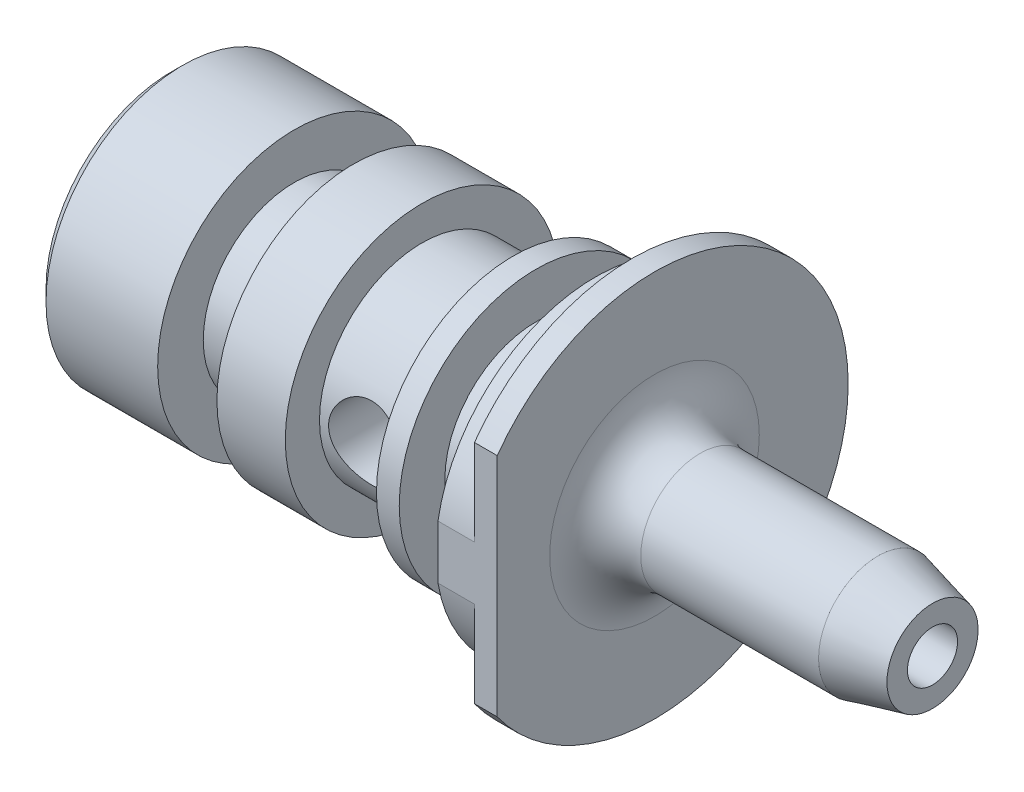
ISO-10303-21;
HEADER;
FILE_DESCRIPTION(('STEP AP214'),'2;1');
FILE_NAME('part.step','',(''),(''),'','','');
FILE_SCHEMA(('AUTOMOTIVE_DESIGN { 1 0 10303 214 1 1 1 1 }'));
ENDSEC;
DATA;
#1=APPLICATION_CONTEXT('core data for automotive mechanical design processes');
#2=APPLICATION_PROTOCOL_DEFINITION('international standard','automotive_design',2000,#1);
#3=PRODUCT_CONTEXT('',#1,'mechanical');
#4=PRODUCT('Part','Part','',(#3));
#5=PRODUCT_RELATED_PRODUCT_CATEGORY('part','',(#4));
#6=PRODUCT_DEFINITION_FORMATION('','',#4);
#7=PRODUCT_DEFINITION_CONTEXT('part definition',#1,'design');
#8=PRODUCT_DEFINITION('design','',#6,#7);
#9=PRODUCT_DEFINITION_SHAPE('','',#8);
#10=(LENGTH_UNIT() NAMED_UNIT(*) SI_UNIT(.MILLI.,.METRE.));
#11=(NAMED_UNIT(*) PLANE_ANGLE_UNIT() SI_UNIT($,.RADIAN.));
#12=(NAMED_UNIT(*) SI_UNIT($,.STERADIAN.) SOLID_ANGLE_UNIT());
#13=UNCERTAINTY_MEASURE_WITH_UNIT(LENGTH_MEASURE(1.E-05),#10,'distance_accuracy_value','');
#14=(GEOMETRIC_REPRESENTATION_CONTEXT(3) GLOBAL_UNCERTAINTY_ASSIGNED_CONTEXT((#13)) GLOBAL_UNIT_ASSIGNED_CONTEXT((#10,
#11,#12)) REPRESENTATION_CONTEXT('',''));
#15=CARTESIAN_POINT('',(0.,0.,0.));
#16=DIRECTION('',(0.,0.,1.));
#17=DIRECTION('',(1.,0.,0.));
#18=AXIS2_PLACEMENT_3D('',#15,#16,#17);
#19=CARTESIAN_POINT('',(0.00125000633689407,0.,0.));
#20=DIRECTION('',(-1.,0.,0.));
#21=DIRECTION('',(0.,0.,1.));
#22=AXIS2_PLACEMENT_3D('',#19,#20,#21);
#23=CYLINDRICAL_SURFACE('',#22,0.550000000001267);
#24=CARTESIAN_POINT('',(-9.4,0.,0.550000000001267));
#25=CARTESIAN_POINT('',(-9.39999999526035,-0.0274525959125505,0.55000003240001));
#26=CARTESIAN_POINT('',(-9.40142523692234,-0.054905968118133,0.547933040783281));
#27=CARTESIAN_POINT('',(-9.40698534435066,-0.108932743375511,0.539797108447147));
#28=CARTESIAN_POINT('',(-9.41112162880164,-0.135505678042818,0.533726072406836));
#29=CARTESIAN_POINT('',(-9.42169903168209,-0.186905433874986,0.517963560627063));
#30=CARTESIAN_POINT('',(-9.42812895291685,-0.211740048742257,0.508289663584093));
#31=CARTESIAN_POINT('',(-9.44278574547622,-0.259320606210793,0.485743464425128));
#32=CARTESIAN_POINT('',(-9.45101285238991,-0.282066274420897,0.472870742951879));
#33=CARTESIAN_POINT('',(-9.46947191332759,-0.32706324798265,0.443080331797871));
#34=CARTESIAN_POINT('',(-9.47981607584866,-0.349098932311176,0.425907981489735));
#35=CARTESIAN_POINT('',(-9.50121567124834,-0.390177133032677,0.38862925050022));
#36=CARTESIAN_POINT('',(-9.51227213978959,-0.409215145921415,0.36851854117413));
#37=CARTESIAN_POINT('',(-9.53613320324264,-0.447057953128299,0.322002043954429));
#38=CARTESIAN_POINT('',(-9.54891709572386,-0.465278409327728,0.295106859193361));
#39=CARTESIAN_POINT('',(-9.5727485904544,-0.496938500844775,0.237939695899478));
#40=CARTESIAN_POINT('',(-9.58379913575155,-0.510386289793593,0.207673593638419));
#41=CARTESIAN_POINT('',(-9.5994031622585,-0.528565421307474,0.153827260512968));
#42=CARTESIAN_POINT('',(-9.60491068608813,-0.534703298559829,0.131001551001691));
#43=CARTESIAN_POINT('',(-9.61341190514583,-0.544017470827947,0.0843156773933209));
#44=CARTESIAN_POINT('',(-9.61641027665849,-0.547199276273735,0.0604575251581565));
#45=CARTESIAN_POINT('',(-9.61942451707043,-0.550397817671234,0.012210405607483));
#46=CARTESIAN_POINT('',(-9.61942522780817,-0.550398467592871,-0.0121806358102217));
#47=CARTESIAN_POINT('',(-9.61640459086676,-0.547193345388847,-0.0605669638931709));
#48=CARTESIAN_POINT('',(-9.61338108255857,-0.543985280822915,-0.0845619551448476));
#49=CARTESIAN_POINT('',(-9.60505782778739,-0.534863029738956,-0.13011933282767));
#50=CARTESIAN_POINT('',(-9.59989856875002,-0.529114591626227,-0.151742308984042));
#51=CARTESIAN_POINT('',(-9.58793508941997,-0.515228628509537,-0.193724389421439));
#52=CARTESIAN_POINT('',(-9.5811295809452,-0.50708923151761,-0.214082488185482));
#53=CARTESIAN_POINT('',(-9.56276180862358,-0.483983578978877,-0.26330117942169));
#54=CARTESIAN_POINT('',(-9.55053156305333,-0.467644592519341,-0.291271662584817));
#55=CARTESIAN_POINT('',(-9.52535307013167,-0.430530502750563,-0.343772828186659));
#56=CARTESIAN_POINT('',(-9.51240347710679,-0.409746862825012,-0.368296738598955));
#57=CARTESIAN_POINT('',(-9.48702112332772,-0.363808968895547,-0.413759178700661));
#58=CARTESIAN_POINT('',(-9.47459464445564,-0.338614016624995,-0.434660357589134));
#59=CARTESIAN_POINT('',(-9.45165852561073,-0.284338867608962,-0.471943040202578));
#60=CARTESIAN_POINT('',(-9.4411449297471,-0.255266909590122,-0.488333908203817));
#61=CARTESIAN_POINT('',(-9.42517375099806,-0.200662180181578,-0.512757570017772));
#62=CARTESIAN_POINT('',(-9.41911197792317,-0.175774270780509,-0.521837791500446));
#63=CARTESIAN_POINT('',(-9.40932111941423,-0.124521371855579,-0.536378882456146));
#64=CARTESIAN_POINT('',(-9.40559045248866,-0.0981573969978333,-0.54184220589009));
#65=CARTESIAN_POINT('',(-9.4007883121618,-0.0445708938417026,-0.548858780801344));
#66=CARTESIAN_POINT('',(-9.39972646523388,-0.017345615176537,-0.550397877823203));
#67=CARTESIAN_POINT('',(-9.40039424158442,0.0369987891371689,-0.54942654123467));
#68=CARTESIAN_POINT('',(-9.40212391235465,0.0641179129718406,-0.546916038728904));
#69=CARTESIAN_POINT('',(-9.40802948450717,0.115854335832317,-0.538262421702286));
#70=CARTESIAN_POINT('',(-9.41205885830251,0.140525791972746,-0.532336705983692));
#71=CARTESIAN_POINT('',(-9.42212553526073,0.188444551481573,-0.51731967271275));
#72=CARTESIAN_POINT('',(-9.4281632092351,0.21169159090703,-0.508227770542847));
#73=CARTESIAN_POINT('',(-9.44235566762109,0.258085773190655,-0.486414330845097));
#74=CARTESIAN_POINT('',(-9.4506378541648,0.281086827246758,-0.473466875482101));
#75=CARTESIAN_POINT('',(-9.46846875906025,0.324681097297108,-0.444708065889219));
#76=CARTESIAN_POINT('',(-9.47801837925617,0.34527257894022,-0.42889466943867));
#77=CARTESIAN_POINT('',(-9.49944994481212,0.387132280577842,-0.391838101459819));
#78=CARTESIAN_POINT('',(-9.51145322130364,0.407926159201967,-0.370128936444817));
#79=CARTESIAN_POINT('',(-9.53532435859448,0.445765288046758,-0.323564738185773));
#80=CARTESIAN_POINT('',(-9.54719213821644,0.462808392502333,-0.298707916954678));
#81=CARTESIAN_POINT('',(-9.56814593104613,0.490946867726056,-0.249347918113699));
#82=CARTESIAN_POINT('',(-9.57739429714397,0.502518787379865,-0.225186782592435));
#83=CARTESIAN_POINT('',(-9.59378173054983,0.522172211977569,-0.174823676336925));
#84=CARTESIAN_POINT('',(-9.60092493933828,0.530260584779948,-0.148625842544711));
#85=CARTESIAN_POINT('',(-9.61099815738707,0.541408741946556,-0.0994654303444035));
#86=CARTESIAN_POINT('',(-9.61445206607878,0.545107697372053,-0.076758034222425));
#87=CARTESIAN_POINT('',(-9.61868335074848,0.549619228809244,-0.0308196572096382));
#88=CARTESIAN_POINT('',(-9.61946350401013,0.55043479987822,-0.00758924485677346));
#89=CARTESIAN_POINT('',(-9.61822478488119,0.549124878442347,0.0387101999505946));
#90=CARTESIAN_POINT('',(-9.61620575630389,0.546999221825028,0.0617792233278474));
#91=CARTESIAN_POINT('',(-9.60968507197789,0.539954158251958,0.107136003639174));
#92=CARTESIAN_POINT('',(-9.60517986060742,0.535030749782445,0.129422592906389));
#93=CARTESIAN_POINT('',(-9.59258975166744,0.520738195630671,0.179446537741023));
#94=CARTESIAN_POINT('',(-9.58383016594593,0.510467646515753,0.206753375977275));
#95=CARTESIAN_POINT('',(-9.56444321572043,0.486116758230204,0.258885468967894));
#96=CARTESIAN_POINT('',(-9.55381301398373,0.47203061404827,0.283706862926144));
#97=CARTESIAN_POINT('',(-9.53161493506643,0.440055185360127,0.331191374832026));
#98=CARTESIAN_POINT('',(-9.52003174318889,0.422090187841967,0.353796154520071));
#99=CARTESIAN_POINT('',(-9.49714288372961,0.382766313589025,0.396007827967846));
#100=CARTESIAN_POINT('',(-9.48583730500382,0.361406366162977,0.415613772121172));
#101=CARTESIAN_POINT('',(-9.46281486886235,0.312094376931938,0.454107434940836));
#102=CARTESIAN_POINT('',(-9.45128220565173,0.283634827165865,0.47246513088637));
#103=CARTESIAN_POINT('',(-9.43105751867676,0.223028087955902,0.503901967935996));
#104=CARTESIAN_POINT('',(-9.42236037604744,0.190887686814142,0.516990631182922));
#105=CARTESIAN_POINT('',(-9.41058242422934,0.132223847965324,0.534518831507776));
#106=CARTESIAN_POINT('',(-9.40664567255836,0.106268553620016,0.540295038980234));
#107=CARTESIAN_POINT('',(-9.40135540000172,0.0535420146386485,0.548034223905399));
#108=CARTESIAN_POINT('',(-9.40000000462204,0.0267713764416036,0.54999996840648));
#109=CARTESIAN_POINT('',(-9.4,0.,0.550000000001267));
#110=B_SPLINE_CURVE_WITH_KNOTS('',3,(#24,#25,#26,#27,#28,#29,#30,#31,#32,#33,#34,#35,#36,#37,
#38,#39,#40,#41,#42,#43,#44,#45,#46,#47,#48,#49,#50,#51,#52,#53,#54,#55,#56,#57,#58,#59,#60,#61,
#62,#63,#64,#65,#66,#67,#68,#69,#70,#71,#72,#73,#74,#75,#76,#77,#78,#79,#80,#81,#82,#83,#84,#85,
#86,#87,#88,#89,#90,#91,#92,#93,#94,#95,#96,#97,#98,#99,#100,#101,#102,#103,#104,#105,#106,#107,
#108,#109),.UNSPECIFIED.,.T.,.F.,(4,2,2,2,2,2,2,2,2,2,2,2,2,2,2,2,2,2,2,2,2,2,2,2,2,2,2,2,2,2,2,
2,2,2,2,2,2,2,2,2,2,2,4),(0.,0.0822491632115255,0.164541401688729,0.246437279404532,
0.328343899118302,0.417384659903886,0.506557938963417,0.610817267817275,0.71489761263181,
0.787426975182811,0.859820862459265,0.932580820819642,1.00539279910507,1.07402898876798,
1.14271906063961,1.24605225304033,1.34958572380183,1.45413022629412,1.55845600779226,
1.63964621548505,1.72078128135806,1.80220858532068,1.88363727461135,1.96037917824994,
2.03713525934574,2.11981333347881,2.20255055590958,2.29927822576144,2.3960610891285,
2.48078149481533,2.56533409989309,2.63482239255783,2.70423848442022,2.77365844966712,
2.84317795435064,2.93406874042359,3.0250985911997,3.11809859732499,3.2111279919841,
3.31784387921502,3.42436603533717,3.50463254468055,3.58484074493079),.UNSPECIFIED.);
#111=CARTESIAN_POINT('',(-9.4,0.,0.550000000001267));
#112=VERTEX_POINT('',#111);
#113=EDGE_CURVE('E459',#112,#112,#110,.T.);
#114=ORIENTED_EDGE('',*,*,#113,.F.);
#115=EDGE_LOOP('',(#114));
#116=FACE_BOUND('',#115,.T.);
#117=CARTESIAN_POINT('',(0.,0.,0.));
#118=DIRECTION('',(-1.,0.,0.));
#119=DIRECTION('',(0.,0.,1.));
#120=AXIS2_PLACEMENT_3D('',#117,#118,#119);
#121=CIRCLE('',#120,0.550000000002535);
#122=CARTESIAN_POINT('',(0.,0.,0.550000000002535));
#123=VERTEX_POINT('',#122);
#124=EDGE_CURVE('E422',#123,#123,#121,.T.);
#125=ORIENTED_EDGE('',*,*,#124,.F.);
#126=EDGE_LOOP('',(#125));
#127=FACE_BOUND('',#126,.T.);
#128=ADVANCED_FACE('F350',(#116,#127),#23,.F.);
#129=CARTESIAN_POINT('',(0.,1.,0.));
#130=DIRECTION('',(1.,0.,0.));
#131=DIRECTION('',(0.,0.,-1.));
#132=AXIS2_PLACEMENT_3D('',#129,#130,#131);
#133=PLANE('',#132);
#134=ORIENTED_EDGE('',*,*,#124,.T.);
#135=EDGE_LOOP('',(#134));
#136=FACE_BOUND('',#135,.T.);
#137=CARTESIAN_POINT('',(0.,0.,0.));
#138=DIRECTION('',(-1.,0.,0.));
#139=DIRECTION('',(0.,0.,1.));
#140=AXIS2_PLACEMENT_3D('',#137,#138,#139);
#141=CIRCLE('',#140,1.);
#142=CARTESIAN_POINT('',(0.,0.,1.));
#143=VERTEX_POINT('',#142);
#144=EDGE_CURVE('E414',#143,#143,#141,.T.);
#145=ORIENTED_EDGE('',*,*,#144,.F.);
#146=EDGE_LOOP('',(#145));
#147=FACE_BOUND('',#146,.T.);
#148=ADVANCED_FACE('F536',(#136,#147),#133,.T.);
#149=CARTESIAN_POINT('',(-1.2,0.,0.));
#150=DIRECTION('',(-1.,0.,0.));
#151=DIRECTION('',(0.,0.,1.));
#152=AXIS2_PLACEMENT_3D('',#149,#150,#151);
#153=CONICAL_SURFACE('',#152,1.3,0.244978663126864);
#154=ORIENTED_EDGE('',*,*,#144,.T.);
#155=EDGE_LOOP('',(#154));
#156=FACE_BOUND('',#155,.T.);
#157=CARTESIAN_POINT('',(-1.2,0.,0.));
#158=DIRECTION('',(-1.,0.,0.));
#159=DIRECTION('',(0.,0.,1.));
#160=AXIS2_PLACEMENT_3D('',#157,#158,#159);
#161=CIRCLE('',#160,1.3);
#162=CARTESIAN_POINT('',(-1.2,0.,1.3));
#163=VERTEX_POINT('',#162);
#164=EDGE_CURVE('E410',#163,#163,#161,.T.);
#165=ORIENTED_EDGE('',*,*,#164,.F.);
#166=EDGE_LOOP('',(#165));
#167=FACE_BOUND('',#166,.T.);
#168=ADVANCED_FACE('F541',(#156,#167),#153,.T.);
#169=CARTESIAN_POINT('',(0.00125000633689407,0.,0.));
#170=DIRECTION('',(-1.,0.,0.));
#171=DIRECTION('',(0.,0.,1.));
#172=AXIS2_PLACEMENT_3D('',#169,#170,#171);
#173=CYLINDRICAL_SURFACE('',#172,1.30000000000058);
#174=CARTESIAN_POINT('',(-5.1,0.,0.));
#175=DIRECTION('',(1.,0.,0.));
#176=DIRECTION('',(0.,0.,-1.));
#177=AXIS2_PLACEMENT_3D('',#174,#175,#176);
#178=CIRCLE('',#177,1.30000000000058);
#179=CARTESIAN_POINT('',(-5.1,0.,-1.30000000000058));
#180=VERTEX_POINT('',#179);
#181=EDGE_CURVE('E11',#180,#180,#178,.T.);
#182=ORIENTED_EDGE('',*,*,#181,.T.);
#183=EDGE_LOOP('',(#182));
#184=FACE_BOUND('',#183,.T.);
#185=ORIENTED_EDGE('',*,*,#164,.T.);
#186=EDGE_LOOP('',(#185));
#187=FACE_BOUND('',#186,.T.);
#188=ADVANCED_FACE('F722',(#184,#187),#173,.T.);
#189=CARTESIAN_POINT('',(-6.1,4.25,0.));
#190=DIRECTION('',(1.,0.,0.));
#191=DIRECTION('',(0.,0.,-1.));
#192=AXIS2_PLACEMENT_3D('',#189,#190,#191);
#193=PLANE('',#192);
#194=CARTESIAN_POINT('',(-6.1,0.,0.));
#195=DIRECTION('',(1.,0.,0.));
#196=DIRECTION('',(0.,0.,-1.));
#197=AXIS2_PLACEMENT_3D('',#194,#195,#196);
#198=CIRCLE('',#197,2.30000000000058);
#199=CARTESIAN_POINT('',(-6.1,0.,-2.30000000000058));
#200=VERTEX_POINT('',#199);
#201=EDGE_CURVE('E359',#200,#200,#198,.F.);
#202=ORIENTED_EDGE('',*,*,#201,.T.);
#203=EDGE_LOOP('',(#202));
#204=FACE_BOUND('',#203,.T.);
#205=DIRECTION('',(0.,1.,0.));
#206=VECTOR('',#205,1.);
#207=CARTESIAN_POINT('',(-6.1,3.07634476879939,3.45));
#208=LINE('',#207,#206);
#209=CARTESIAN_POINT('',(-6.1,-2.48193472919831,3.45));
#210=VERTEX_POINT('',#209);
#211=CARTESIAN_POINT('',(-6.1,2.48193472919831,3.45));
#212=VERTEX_POINT('',#211);
#213=EDGE_CURVE('E393',#210,#212,#208,.T.);
#214=ORIENTED_EDGE('',*,*,#213,.F.);
#215=CARTESIAN_POINT('',(-6.1,0.,0.));
#216=DIRECTION('',(-1.,0.,0.));
#217=DIRECTION('',(0.,0.,1.));
#218=AXIS2_PLACEMENT_3D('',#215,#216,#217);
#219=CIRCLE('',#218,4.25);
#220=EDGE_CURVE('E407',#212,#210,#219,.T.);
#221=ORIENTED_EDGE('',*,*,#220,.F.);
#222=EDGE_LOOP('',(#214,#221));
#223=FACE_BOUND('',#222,.T.);
#224=ADVANCED_FACE('F406',(#204,#223),#193,.T.);
#225=CARTESIAN_POINT('',(0.00125000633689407,0.,0.));
#226=DIRECTION('',(-1.,0.,0.));
#227=DIRECTION('',(0.,0.,1.));
#228=AXIS2_PLACEMENT_3D('',#225,#226,#227);
#229=CYLINDRICAL_SURFACE('',#228,4.25000000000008);
#230=DIRECTION('',(-1.,0.,0.));
#231=VECTOR('',#230,1.);
#232=CARTESIAN_POINT('',(0.00125000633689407,-2.48193472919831,3.45));
#233=LINE('',#232,#231);
#234=CARTESIAN_POINT('',(-6.6,-2.48193472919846,3.45));
#235=VERTEX_POINT('',#234);
#236=EDGE_CURVE('E390',#235,#210,#233,.F.);
#237=ORIENTED_EDGE('',*,*,#236,.F.);
#238=CARTESIAN_POINT('',(-6.6,0.,0.));
#239=DIRECTION('',(-1.,0.,0.));
#240=DIRECTION('',(0.,0.,1.));
#241=AXIS2_PLACEMENT_3D('',#238,#239,#240);
#242=CIRCLE('',#241,4.25000000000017);
#243=CARTESIAN_POINT('',(-6.6,2.48193472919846,3.45));
#244=VERTEX_POINT('',#243);
#245=EDGE_CURVE('E411',#244,#235,#242,.T.);
#246=ORIENTED_EDGE('',*,*,#245,.F.);
#247=DIRECTION('',(-1.,0.,0.));
#248=VECTOR('',#247,1.);
#249=CARTESIAN_POINT('',(0.00125000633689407,2.48193472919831,3.45));
#250=LINE('',#249,#248);
#251=EDGE_CURVE('E402',#212,#244,#250,.T.);
#252=ORIENTED_EDGE('',*,*,#251,.F.);
#253=ORIENTED_EDGE('',*,*,#220,.T.);
#254=EDGE_LOOP('',(#237,#246,#252,#253));
#255=FACE_BOUND('',#254,.T.);
#256=ADVANCED_FACE('F409',(#255),#229,.T.);
#257=CARTESIAN_POINT('',(-6.6,3.5,0.));
#258=DIRECTION('',(-1.,0.,0.));
#259=DIRECTION('',(0.,0.,1.));
#260=AXIS2_PLACEMENT_3D('',#257,#258,#259);
#261=PLANE('',#260);
#262=DIRECTION('',(0.,-1.,0.));
#263=VECTOR('',#262,1.);
#264=CARTESIAN_POINT('',(-6.6,3.5,3.45));
#265=LINE('',#264,#263);
#266=CARTESIAN_POINT('',(-6.6,0.589491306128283,3.45));
#267=VERTEX_POINT('',#266);
#268=EDGE_CURVE('E519',#244,#267,#265,.T.);
#269=ORIENTED_EDGE('',*,*,#268,.F.);
#270=ORIENTED_EDGE('',*,*,#245,.T.);
#271=CARTESIAN_POINT('',(-6.6,-0.589491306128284,3.45));
#272=VERTEX_POINT('',#271);
#273=EDGE_CURVE('E396',#272,#235,#265,.T.);
#274=ORIENTED_EDGE('',*,*,#273,.F.);
#275=CARTESIAN_POINT('',(-6.6,0.,0.));
#276=DIRECTION('',(-1.,0.,0.));
#277=DIRECTION('',(0.,0.,1.));
#278=AXIS2_PLACEMENT_3D('',#275,#276,#277);
#279=CIRCLE('',#278,3.5);
#280=EDGE_CURVE('E416',#267,#272,#279,.T.);
#281=ORIENTED_EDGE('',*,*,#280,.F.);
#282=EDGE_LOOP('',(#269,#270,#274,#281));
#283=FACE_BOUND('',#282,.T.);
#284=ADVANCED_FACE('F518',(#283),#261,.T.);
#285=CARTESIAN_POINT('',(0.00125000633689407,0.,0.));
#286=DIRECTION('',(-1.,0.,0.));
#287=DIRECTION('',(0.,0.,1.));
#288=AXIS2_PLACEMENT_3D('',#285,#286,#287);
#289=CYLINDRICAL_SURFACE('',#288,3.50000000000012);
#290=DIRECTION('',(-1.,0.,0.));
#291=VECTOR('',#290,1.);
#292=CARTESIAN_POINT('',(0.00125000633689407,-0.589491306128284,3.45));
#293=LINE('',#292,#291);
#294=CARTESIAN_POINT('',(-7.4,-0.589491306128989,3.45));
#295=VERTEX_POINT('',#294);
#296=EDGE_CURVE('E515',#295,#272,#293,.F.);
#297=ORIENTED_EDGE('',*,*,#296,.F.);
#298=CARTESIAN_POINT('',(-7.4,0.,0.));
#299=DIRECTION('',(-1.,0.,0.));
#300=DIRECTION('',(0.,0.,1.));
#301=AXIS2_PLACEMENT_3D('',#298,#299,#300);
#302=CIRCLE('',#301,3.50000000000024);
#303=CARTESIAN_POINT('',(-7.4,0.589491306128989,3.45));
#304=VERTEX_POINT('',#303);
#305=EDGE_CURVE('E507',#304,#295,#302,.T.);
#306=ORIENTED_EDGE('',*,*,#305,.F.);
#307=DIRECTION('',(-1.,0.,0.));
#308=VECTOR('',#307,1.);
#309=CARTESIAN_POINT('',(0.00125000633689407,0.589491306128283,3.45));
#310=LINE('',#309,#308);
#311=EDGE_CURVE('E366',#267,#304,#310,.T.);
#312=ORIENTED_EDGE('',*,*,#311,.F.);
#313=ORIENTED_EDGE('',*,*,#280,.T.);
#314=EDGE_LOOP('',(#297,#306,#312,#313));
#315=FACE_BOUND('',#314,.T.);
#316=ADVANCED_FACE('F513',(#315),#289,.T.);
#317=CARTESIAN_POINT('',(-7.4,2.,0.));
#318=DIRECTION('',(-1.,0.,0.));
#319=DIRECTION('',(0.,0.,1.));
#320=AXIS2_PLACEMENT_3D('',#317,#318,#319);
#321=PLANE('',#320);
#322=DIRECTION('',(0.,-1.,0.));
#323=VECTOR('',#322,1.);
#324=CARTESIAN_POINT('',(-7.4,2.,3.45));
#325=LINE('',#324,#323);
#326=EDGE_CURVE('E425',#304,#295,#325,.T.);
#327=ORIENTED_EDGE('',*,*,#326,.F.);
#328=ORIENTED_EDGE('',*,*,#305,.T.);
#329=EDGE_LOOP('',(#327,#328));
#330=FACE_BOUND('',#329,.T.);
#331=CARTESIAN_POINT('',(-7.4,0.,0.));
#332=DIRECTION('',(-1.,0.,0.));
#333=DIRECTION('',(0.,0.,1.));
#334=AXIS2_PLACEMENT_3D('',#331,#332,#333);
#335=CIRCLE('',#334,2.);
#336=CARTESIAN_POINT('',(-7.4,0.,2.));
#337=VERTEX_POINT('',#336);
#338=EDGE_CURVE('E504',#337,#337,#335,.T.);
#339=ORIENTED_EDGE('',*,*,#338,.F.);
#340=EDGE_LOOP('',(#339));
#341=FACE_BOUND('',#340,.T.);
#342=ADVANCED_FACE('F690',(#330,#341),#321,.T.);
#343=CARTESIAN_POINT('',(0.00125000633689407,0.,0.));
#344=DIRECTION('',(-1.,0.,0.));
#345=DIRECTION('',(0.,0.,1.));
#346=AXIS2_PLACEMENT_3D('',#343,#344,#345);
#347=CYLINDRICAL_SURFACE('',#346,2.00000000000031);
#348=ORIENTED_EDGE('',*,*,#338,.T.);
#349=EDGE_LOOP('',(#348));
#350=FACE_BOUND('',#349,.T.);
#351=CARTESIAN_POINT('',(-8.7,0.,0.));
#352=DIRECTION('',(-1.,0.,0.));
#353=DIRECTION('',(0.,0.,1.));
#354=AXIS2_PLACEMENT_3D('',#351,#352,#353);
#355=CIRCLE('',#354,2.00000000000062);
#356=CARTESIAN_POINT('',(-8.7,0.,2.00000000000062));
#357=VERTEX_POINT('',#356);
#358=EDGE_CURVE('E501',#357,#357,#355,.T.);
#359=ORIENTED_EDGE('',*,*,#358,.F.);
#360=EDGE_LOOP('',(#359));
#361=FACE_BOUND('',#360,.T.);
#362=ADVANCED_FACE('F682',(#350,#361),#347,.T.);
#363=CARTESIAN_POINT('',(-8.7,3.,0.));
#364=DIRECTION('',(1.,0.,0.));
#365=DIRECTION('',(0.,0.,-1.));
#366=AXIS2_PLACEMENT_3D('',#363,#364,#365);
#367=PLANE('',#366);
#368=ORIENTED_EDGE('',*,*,#358,.T.);
#369=EDGE_LOOP('',(#368));
#370=FACE_BOUND('',#369,.T.);
#371=CARTESIAN_POINT('',(-8.7,0.,0.));
#372=DIRECTION('',(-1.,0.,0.));
#373=DIRECTION('',(0.,0.,1.));
#374=AXIS2_PLACEMENT_3D('',#371,#372,#373);
#375=CIRCLE('',#374,3.);
#376=CARTESIAN_POINT('',(-8.7,0.,3.));
#377=VERTEX_POINT('',#376);
#378=EDGE_CURVE('E498',#377,#377,#375,.T.);
#379=ORIENTED_EDGE('',*,*,#378,.F.);
#380=EDGE_LOOP('',(#379));
#381=FACE_BOUND('',#380,.T.);
#382=ADVANCED_FACE('F674',(#370,#381),#367,.T.);
#383=CARTESIAN_POINT('',(0.00125000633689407,0.,0.));
#384=DIRECTION('',(-1.,0.,0.));
#385=DIRECTION('',(0.,0.,1.));
#386=AXIS2_PLACEMENT_3D('',#383,#384,#385);
#387=CYLINDRICAL_SURFACE('',#386,3.00000000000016);
#388=ORIENTED_EDGE('',*,*,#378,.T.);
#389=EDGE_LOOP('',(#388));
#390=FACE_BOUND('',#389,.T.);
#391=CARTESIAN_POINT('',(-9.2,0.,0.));
#392=DIRECTION('',(-1.,0.,0.));
#393=DIRECTION('',(0.,0.,1.));
#394=AXIS2_PLACEMENT_3D('',#391,#392,#393);
#395=CIRCLE('',#394,3.00000000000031);
#396=CARTESIAN_POINT('',(-9.2,0.,3.00000000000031));
#397=VERTEX_POINT('',#396);
#398=EDGE_CURVE('E495',#397,#397,#395,.T.);
#399=ORIENTED_EDGE('',*,*,#398,.F.);
#400=EDGE_LOOP('',(#399));
#401=FACE_BOUND('',#400,.T.);
#402=ADVANCED_FACE('F667',(#390,#401),#387,.T.);
#403=CARTESIAN_POINT('',(-9.2,2.25,0.));
#404=DIRECTION('',(-1.,0.,0.));
#405=DIRECTION('',(0.,0.,1.));
#406=AXIS2_PLACEMENT_3D('',#403,#404,#405);
#407=PLANE('',#406);
#408=ORIENTED_EDGE('',*,*,#398,.T.);
#409=EDGE_LOOP('',(#408));
#410=FACE_BOUND('',#409,.T.);
#411=CARTESIAN_POINT('',(-9.2,0.,0.));
#412=DIRECTION('',(-1.,0.,0.));
#413=DIRECTION('',(0.,0.,1.));
#414=AXIS2_PLACEMENT_3D('',#411,#412,#413);
#415=CIRCLE('',#414,2.25);
#416=CARTESIAN_POINT('',(-9.2,0.,2.25));
#417=VERTEX_POINT('',#416);
#418=EDGE_CURVE('E492',#417,#417,#415,.T.);
#419=ORIENTED_EDGE('',*,*,#418,.F.);
#420=EDGE_LOOP('',(#419));
#421=FACE_BOUND('',#420,.T.);
#422=ADVANCED_FACE('F564',(#410,#421),#407,.T.);
#423=CARTESIAN_POINT('',(0.00125000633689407,0.,0.));
#424=DIRECTION('',(-1.,0.,0.));
#425=DIRECTION('',(0.,0.,1.));
#426=AXIS2_PLACEMENT_3D('',#423,#424,#425);
#427=CYLINDRICAL_SURFACE('',#426,2.25000000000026);
#428=CARTESIAN_POINT('',(-9.4,0.,2.25000000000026));
#429=CARTESIAN_POINT('',(-9.3999991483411,0.0434811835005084,2.25000060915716));
#430=CARTESIAN_POINT('',(-9.40355621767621,0.0869562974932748,2.24872830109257));
#431=CARTESIAN_POINT('',(-9.41763973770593,0.17261602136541,2.24377904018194));
#432=CARTESIAN_POINT('',(-9.42816598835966,0.214800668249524,2.24010215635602));
#433=CARTESIAN_POINT('',(-9.45577448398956,0.296632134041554,2.23074077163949));
#434=CARTESIAN_POINT('',(-9.47284488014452,0.336283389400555,2.22505990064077));
#435=CARTESIAN_POINT('',(-9.51300004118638,0.412158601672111,2.21226300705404));
#436=CARTESIAN_POINT('',(-9.53608623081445,0.448381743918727,2.20514664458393));
#437=CARTESIAN_POINT('',(-9.58855490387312,0.517776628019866,2.18991189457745));
#438=CARTESIAN_POINT('',(-9.61812922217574,0.55079750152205,2.18176718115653));
#439=CARTESIAN_POINT('',(-9.68232720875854,0.61152944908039,2.16553037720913));
#440=CARTESIAN_POINT('',(-9.71695220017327,0.639239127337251,2.1574383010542));
#441=CARTESIAN_POINT('',(-9.79168680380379,0.689473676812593,2.14192480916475));
#442=CARTESIAN_POINT('',(-9.83194134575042,0.711793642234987,2.13453496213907));
#443=CARTESIAN_POINT('',(-9.91593766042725,0.749280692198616,2.12166778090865));
#444=CARTESIAN_POINT('',(-9.95967819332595,0.764450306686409,2.11618977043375));
#445=CARTESIAN_POINT('',(-10.0476770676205,0.786624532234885,2.10804589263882));
#446=CARTESIAN_POINT('',(-10.0918540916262,0.793914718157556,2.10528202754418));
#447=CARTESIAN_POINT('',(-10.180884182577,0.801016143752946,2.10259101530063));
#448=CARTESIAN_POINT('',(-10.2257369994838,0.800830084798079,2.10266284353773));
#449=CARTESIAN_POINT('',(-10.3123207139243,0.79320425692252,2.10554993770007));
#450=CARTESIAN_POINT('',(-10.3540911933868,0.78614895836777,2.10821978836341));
#451=CARTESIAN_POINT('',(-10.4358113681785,0.765616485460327,2.11576222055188));
#452=CARTESIAN_POINT('',(-10.4757608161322,0.752138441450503,2.12063510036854));
#453=CARTESIAN_POINT('',(-10.5535312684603,0.718912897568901,2.13212964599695));
#454=CARTESIAN_POINT('',(-10.5913022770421,0.699058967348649,2.13878065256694));
#455=CARTESIAN_POINT('',(-10.6630929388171,0.653719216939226,2.1530710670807));
#456=CARTESIAN_POINT('',(-10.6971113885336,0.628231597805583,2.1607107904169));
#457=CARTESIAN_POINT('',(-10.7625754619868,0.570547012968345,2.17667697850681));
#458=CARTESIAN_POINT('',(-10.7937447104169,0.538039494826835,2.18501716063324));
#459=CARTESIAN_POINT('',(-10.8502667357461,0.46815905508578,2.2010476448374));
#460=CARTESIAN_POINT('',(-10.8756187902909,0.430785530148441,2.20873786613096));
#461=CARTESIAN_POINT('',(-10.9200511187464,0.351586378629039,2.22272852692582));
#462=CARTESIAN_POINT('',(-10.9390480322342,0.309710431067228,2.22901016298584));
#463=CARTESIAN_POINT('',(-10.9696385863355,0.22307910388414,2.23933800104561));
#464=CARTESIAN_POINT('',(-10.9812351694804,0.178324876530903,2.24338509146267));
#465=CARTESIAN_POINT('',(-10.9961846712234,0.08954004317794,2.24863596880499));
#466=CARTESIAN_POINT('',(-10.9999103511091,0.0455797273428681,2.24996821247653));
#467=CARTESIAN_POINT('',(-11.0000863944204,-0.0423525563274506,2.25003063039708));
#468=CARTESIAN_POINT('',(-10.9965381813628,-0.0863245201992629,2.24876131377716));
#469=CARTESIAN_POINT('',(-10.9825564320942,-0.171478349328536,2.24384813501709));
#470=CARTESIAN_POINT('',(-10.9723596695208,-0.212704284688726,2.24028598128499));
#471=CARTESIAN_POINT('',(-10.9456744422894,-0.292837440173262,2.23122691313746));
#472=CARTESIAN_POINT('',(-10.929185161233,-0.33174435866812,2.2257297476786));
#473=CARTESIAN_POINT('',(-10.8898747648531,-0.40735667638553,2.21315872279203));
#474=CARTESIAN_POINT('',(-10.8668887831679,-0.443969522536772,2.2060449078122));
#475=CARTESIAN_POINT('',(-10.8154270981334,-0.512934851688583,2.19103753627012));
#476=CARTESIAN_POINT('',(-10.7869495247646,-0.545285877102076,2.18314371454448));
#477=CARTESIAN_POINT('',(-10.7235659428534,-0.606564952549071,2.16694161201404));
#478=CARTESIAN_POINT('',(-10.6884026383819,-0.635227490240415,2.15863312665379));
#479=CARTESIAN_POINT('',(-10.6135932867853,-0.686288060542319,2.14294758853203));
#480=CARTESIAN_POINT('',(-10.5739470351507,-0.70868580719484,2.13557057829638));
#481=CARTESIAN_POINT('',(-10.4911346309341,-0.746534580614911,2.12263721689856));
#482=CARTESIAN_POINT('',(-10.4479656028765,-0.761979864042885,2.11708237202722));
#483=CARTESIAN_POINT('',(-10.3593909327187,-0.785295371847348,2.10854649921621));
#484=CARTESIAN_POINT('',(-10.3139865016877,-0.793169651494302,2.10556409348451));
#485=CARTESIAN_POINT('',(-10.2250735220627,-0.800778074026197,2.10268147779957));
#486=CARTESIAN_POINT('',(-10.1816083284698,-0.800959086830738,2.10261206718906));
#487=CARTESIAN_POINT('',(-10.0953022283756,-0.794299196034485,2.10513685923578));
#488=CARTESIAN_POINT('',(-10.0524612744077,-0.787458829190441,2.10773085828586));
#489=CARTESIAN_POINT('',(-9.96968187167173,-0.767283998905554,2.11515617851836));
#490=CARTESIAN_POINT('',(-9.9296979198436,-0.754113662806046,2.11993081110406));
#491=CARTESIAN_POINT('',(-9.85247971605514,-0.721791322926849,2.13115193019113));
#492=CARTESIAN_POINT('',(-9.81524612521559,-0.702637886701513,2.13759881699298));
#493=CARTESIAN_POINT('',(-9.7426294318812,-0.657814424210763,2.15182662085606));
#494=CARTESIAN_POINT('',(-9.70742308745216,-0.631873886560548,2.1596569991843));
#495=CARTESIAN_POINT('',(-9.64171948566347,-0.574649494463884,2.17558247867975));
#496=CARTESIAN_POINT('',(-9.61122365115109,-0.543364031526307,2.18367765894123));
#497=CARTESIAN_POINT('',(-9.55436456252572,-0.474590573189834,2.19967388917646));
#498=CARTESIAN_POINT('',(-9.52826025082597,-0.436881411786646,2.20754829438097));
#499=CARTESIAN_POINT('',(-9.48277934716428,-0.357340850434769,2.22180955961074));
#500=CARTESIAN_POINT('',(-9.46340215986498,-0.315509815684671,2.22819655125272));
#501=CARTESIAN_POINT('',(-9.4320451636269,-0.228844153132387,2.23875752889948));
#502=CARTESIAN_POINT('',(-9.42007147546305,-0.18400707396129,2.24292968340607));
#503=CARTESIAN_POINT('',(-9.40405085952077,-0.0927772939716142,2.24855007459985));
#504=CARTESIAN_POINT('',(-9.40000090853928,-0.046385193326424,2.24999935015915));
#505=CARTESIAN_POINT('',(-9.4,0.,2.25000000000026));
#506=B_SPLINE_CURVE_WITH_KNOTS('',3,(#428,#429,#430,#431,#432,#433,#434,#435,#436,#437,#438,
#439,#440,#441,#442,#443,#444,#445,#446,#447,#448,#449,#450,#451,#452,#453,#454,#455,#456,#457,
#458,#459,#460,#461,#462,#463,#464,#465,#466,#467,#468,#469,#470,#471,#472,#473,#474,#475,#476,
#477,#478,#479,#480,#481,#482,#483,#484,#485,#486,#487,#488,#489,#490,#491,#492,#493,#494,#495,
#496,#497,#498,#499,#500,#501,#502,#503,#504,#505),.UNSPECIFIED.,.T.,.F.,(4,2,2,2,2,2,2,2,2,2,2,
2,2,2,2,2,2,2,2,2,2,2,2,2,2,2,2,2,2,2,2,2,2,2,2,2,2,2,4),(0.,0.13027264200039,0.260541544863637,
0.39057568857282,0.520640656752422,0.655250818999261,0.789896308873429,0.929054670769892,
1.06816375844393,1.20204200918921,1.3358718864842,1.46261796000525,1.58938120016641,
1.71838122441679,1.84742250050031,1.98419731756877,2.12098910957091,2.25951063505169,
2.39797704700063,2.52972352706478,2.66144422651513,2.78871283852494,2.91599796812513,
3.04685891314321,3.17776449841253,3.3154779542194,3.45319769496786,3.59103099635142,
3.72879042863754,3.85853634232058,3.98827233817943,4.1148124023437,4.24138278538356,
4.3740785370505,4.50681429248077,4.64573821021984,4.78464983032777,4.92367614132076,
5.06264939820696),.UNSPECIFIED.);
#507=CARTESIAN_POINT('',(-9.4,0.,2.25000000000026));
#508=VERTEX_POINT('',#507);
#509=EDGE_CURVE('E432',#508,#508,#506,.T.);
#510=ORIENTED_EDGE('',*,*,#509,.F.);
#511=EDGE_LOOP('',(#510));
#512=FACE_BOUND('',#511,.T.);
#513=CARTESIAN_POINT('',(-9.4,0.,-2.25000000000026));
#514=CARTESIAN_POINT('',(-9.3999991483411,-0.0434811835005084,-2.25000060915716));
#515=CARTESIAN_POINT('',(-9.40355621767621,-0.0869562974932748,-2.24872830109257));
#516=CARTESIAN_POINT('',(-9.41763973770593,-0.17261602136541,-2.24377904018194));
#517=CARTESIAN_POINT('',(-9.42816598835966,-0.214800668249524,-2.24010215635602));
#518=CARTESIAN_POINT('',(-9.45577448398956,-0.296632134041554,-2.23074077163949));
#519=CARTESIAN_POINT('',(-9.47284488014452,-0.336283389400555,-2.22505990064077));
#520=CARTESIAN_POINT('',(-9.51300004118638,-0.412158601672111,-2.21226300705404));
#521=CARTESIAN_POINT('',(-9.53608623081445,-0.448381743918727,-2.20514664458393));
#522=CARTESIAN_POINT('',(-9.58855490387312,-0.517776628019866,-2.18991189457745));
#523=CARTESIAN_POINT('',(-9.61812922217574,-0.55079750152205,-2.18176718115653));
#524=CARTESIAN_POINT('',(-9.68232720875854,-0.61152944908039,-2.16553037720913));
#525=CARTESIAN_POINT('',(-9.71695220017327,-0.639239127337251,-2.1574383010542));
#526=CARTESIAN_POINT('',(-9.79168680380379,-0.689473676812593,-2.14192480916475));
#527=CARTESIAN_POINT('',(-9.83194134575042,-0.711793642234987,-2.13453496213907));
#528=CARTESIAN_POINT('',(-9.91593766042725,-0.749280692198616,-2.12166778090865));
#529=CARTESIAN_POINT('',(-9.95967819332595,-0.764450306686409,-2.11618977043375));
#530=CARTESIAN_POINT('',(-10.0476770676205,-0.786624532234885,-2.10804589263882));
#531=CARTESIAN_POINT('',(-10.0918540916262,-0.793914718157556,-2.10528202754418));
#532=CARTESIAN_POINT('',(-10.180884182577,-0.801016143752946,-2.10259101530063));
#533=CARTESIAN_POINT('',(-10.2257369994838,-0.800830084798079,-2.10266284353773));
#534=CARTESIAN_POINT('',(-10.3123207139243,-0.79320425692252,-2.10554993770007));
#535=CARTESIAN_POINT('',(-10.3540911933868,-0.78614895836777,-2.10821978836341));
#536=CARTESIAN_POINT('',(-10.4358113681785,-0.765616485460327,-2.11576222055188));
#537=CARTESIAN_POINT('',(-10.4757608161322,-0.752138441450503,-2.12063510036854));
#538=CARTESIAN_POINT('',(-10.5535312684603,-0.718912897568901,-2.13212964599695));
#539=CARTESIAN_POINT('',(-10.5913022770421,-0.699058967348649,-2.13878065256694));
#540=CARTESIAN_POINT('',(-10.6630929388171,-0.653719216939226,-2.1530710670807));
#541=CARTESIAN_POINT('',(-10.6971113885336,-0.628231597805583,-2.1607107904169));
#542=CARTESIAN_POINT('',(-10.7625754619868,-0.570547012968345,-2.17667697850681));
#543=CARTESIAN_POINT('',(-10.7937447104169,-0.538039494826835,-2.18501716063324));
#544=CARTESIAN_POINT('',(-10.8502667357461,-0.46815905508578,-2.2010476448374));
#545=CARTESIAN_POINT('',(-10.8756187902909,-0.430785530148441,-2.20873786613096));
#546=CARTESIAN_POINT('',(-10.9200511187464,-0.351586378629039,-2.22272852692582));
#547=CARTESIAN_POINT('',(-10.9390480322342,-0.309710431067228,-2.22901016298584));
#548=CARTESIAN_POINT('',(-10.9696385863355,-0.22307910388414,-2.23933800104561));
#549=CARTESIAN_POINT('',(-10.9812351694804,-0.178324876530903,-2.24338509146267));
#550=CARTESIAN_POINT('',(-10.9961846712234,-0.08954004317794,-2.24863596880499));
#551=CARTESIAN_POINT('',(-10.9999103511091,-0.0455797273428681,-2.24996821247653));
#552=CARTESIAN_POINT('',(-11.0000863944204,0.0423525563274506,-2.25003063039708));
#553=CARTESIAN_POINT('',(-10.9965381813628,0.0863245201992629,-2.24876131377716));
#554=CARTESIAN_POINT('',(-10.9825564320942,0.171478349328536,-2.24384813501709));
#555=CARTESIAN_POINT('',(-10.9723596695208,0.212704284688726,-2.24028598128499));
#556=CARTESIAN_POINT('',(-10.9456744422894,0.292837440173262,-2.23122691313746));
#557=CARTESIAN_POINT('',(-10.929185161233,0.33174435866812,-2.2257297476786));
#558=CARTESIAN_POINT('',(-10.8898747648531,0.40735667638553,-2.21315872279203));
#559=CARTESIAN_POINT('',(-10.8668887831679,0.443969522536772,-2.2060449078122));
#560=CARTESIAN_POINT('',(-10.8154270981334,0.512934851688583,-2.19103753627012));
#561=CARTESIAN_POINT('',(-10.7869495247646,0.545285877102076,-2.18314371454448));
#562=CARTESIAN_POINT('',(-10.7235659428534,0.606564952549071,-2.16694161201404));
#563=CARTESIAN_POINT('',(-10.6884026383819,0.635227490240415,-2.15863312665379));
#564=CARTESIAN_POINT('',(-10.6135932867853,0.686288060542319,-2.14294758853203));
#565=CARTESIAN_POINT('',(-10.5739470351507,0.70868580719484,-2.13557057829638));
#566=CARTESIAN_POINT('',(-10.4911346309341,0.746534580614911,-2.12263721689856));
#567=CARTESIAN_POINT('',(-10.4479656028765,0.761979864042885,-2.11708237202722));
#568=CARTESIAN_POINT('',(-10.3593909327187,0.785295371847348,-2.10854649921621));
#569=CARTESIAN_POINT('',(-10.3139865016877,0.793169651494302,-2.10556409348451));
#570=CARTESIAN_POINT('',(-10.2250735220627,0.800778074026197,-2.10268147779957));
#571=CARTESIAN_POINT('',(-10.1816083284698,0.800959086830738,-2.10261206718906));
#572=CARTESIAN_POINT('',(-10.0953022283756,0.794299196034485,-2.10513685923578));
#573=CARTESIAN_POINT('',(-10.0524612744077,0.787458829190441,-2.10773085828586));
#574=CARTESIAN_POINT('',(-9.96968187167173,0.767283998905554,-2.11515617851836));
#575=CARTESIAN_POINT('',(-9.9296979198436,0.754113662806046,-2.11993081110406));
#576=CARTESIAN_POINT('',(-9.85247971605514,0.721791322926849,-2.13115193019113));
#577=CARTESIAN_POINT('',(-9.81524612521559,0.702637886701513,-2.13759881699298));
#578=CARTESIAN_POINT('',(-9.7426294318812,0.657814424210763,-2.15182662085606));
#579=CARTESIAN_POINT('',(-9.70742308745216,0.631873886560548,-2.1596569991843));
#580=CARTESIAN_POINT('',(-9.64171948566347,0.574649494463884,-2.17558247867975));
#581=CARTESIAN_POINT('',(-9.61122365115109,0.543364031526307,-2.18367765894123));
#582=CARTESIAN_POINT('',(-9.55436456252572,0.474590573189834,-2.19967388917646));
#583=CARTESIAN_POINT('',(-9.52826025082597,0.436881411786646,-2.20754829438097));
#584=CARTESIAN_POINT('',(-9.48277934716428,0.357340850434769,-2.22180955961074));
#585=CARTESIAN_POINT('',(-9.46340215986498,0.315509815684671,-2.22819655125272));
#586=CARTESIAN_POINT('',(-9.4320451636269,0.228844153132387,-2.23875752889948));
#587=CARTESIAN_POINT('',(-9.42007147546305,0.18400707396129,-2.24292968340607));
#588=CARTESIAN_POINT('',(-9.40405085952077,0.0927772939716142,-2.24855007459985));
#589=CARTESIAN_POINT('',(-9.40000090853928,0.046385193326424,-2.24999935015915));
#590=CARTESIAN_POINT('',(-9.4,0.,-2.25000000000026));
#591=B_SPLINE_CURVE_WITH_KNOTS('',3,(#513,#514,#515,#516,#517,#518,#519,#520,#521,#522,#523,
#524,#525,#526,#527,#528,#529,#530,#531,#532,#533,#534,#535,#536,#537,#538,#539,#540,#541,#542,
#543,#544,#545,#546,#547,#548,#549,#550,#551,#552,#553,#554,#555,#556,#557,#558,#559,#560,#561,
#562,#563,#564,#565,#566,#567,#568,#569,#570,#571,#572,#573,#574,#575,#576,#577,#578,#579,#580,
#581,#582,#583,#584,#585,#586,#587,#588,#589,#590),.UNSPECIFIED.,.T.,.F.,(4,2,2,2,2,2,2,2,2,2,2,
2,2,2,2,2,2,2,2,2,2,2,2,2,2,2,2,2,2,2,2,2,2,2,2,2,2,2,4),(0.,0.13027264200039,0.260541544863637,
0.39057568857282,0.520640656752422,0.655250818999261,0.789896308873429,0.929054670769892,
1.06816375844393,1.20204200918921,1.3358718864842,1.46261796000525,1.58938120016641,
1.71838122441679,1.84742250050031,1.98419731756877,2.12098910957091,2.25951063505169,
2.39797704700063,2.52972352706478,2.66144422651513,2.78871283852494,2.91599796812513,
3.04685891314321,3.17776449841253,3.3154779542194,3.45319769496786,3.59103099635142,
3.72879042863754,3.85853634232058,3.98827233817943,4.1148124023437,4.24138278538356,
4.3740785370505,4.50681429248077,4.64573821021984,4.78464983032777,4.92367614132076,
5.06264939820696),.UNSPECIFIED.);
#592=CARTESIAN_POINT('',(-9.4,0.,-2.25000000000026));
#593=VERTEX_POINT('',#592);
#594=EDGE_CURVE('E401',#593,#593,#591,.T.);
#595=ORIENTED_EDGE('',*,*,#594,.F.);
#596=EDGE_LOOP('',(#595));
#597=FACE_BOUND('',#596,.T.);
#598=ORIENTED_EDGE('',*,*,#418,.T.);
#599=EDGE_LOOP('',(#598));
#600=FACE_BOUND('',#599,.T.);
#601=CARTESIAN_POINT('',(-11.2,0.,0.));
#602=DIRECTION('',(-1.,0.,0.));
#603=DIRECTION('',(0.,0.,1.));
#604=AXIS2_PLACEMENT_3D('',#601,#602,#603);
#605=CIRCLE('',#604,2.25000000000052);
#606=CARTESIAN_POINT('',(-11.2,0.,2.25000000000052));
#607=VERTEX_POINT('',#606);
#608=EDGE_CURVE('E489',#607,#607,#605,.T.);
#609=ORIENTED_EDGE('',*,*,#608,.F.);
#610=EDGE_LOOP('',(#609));
#611=FACE_BOUND('',#610,.T.);
#612=ADVANCED_FACE('F436',(#512,#597,#600,#611),#427,.T.);
#613=CARTESIAN_POINT('',(-11.2,3.,0.));
#614=DIRECTION('',(1.,0.,0.));
#615=DIRECTION('',(0.,0.,-1.));
#616=AXIS2_PLACEMENT_3D('',#613,#614,#615);
#617=PLANE('',#616);
#618=ORIENTED_EDGE('',*,*,#608,.T.);
#619=EDGE_LOOP('',(#618));
#620=FACE_BOUND('',#619,.T.);
#621=CARTESIAN_POINT('',(-11.2,0.,0.));
#622=DIRECTION('',(-1.,0.,0.));
#623=DIRECTION('',(0.,0.,1.));
#624=AXIS2_PLACEMENT_3D('',#621,#622,#623);
#625=CIRCLE('',#624,3.);
#626=CARTESIAN_POINT('',(-11.2,0.,3.));
#627=VERTEX_POINT('',#626);
#628=EDGE_CURVE('E486',#627,#627,#625,.T.);
#629=ORIENTED_EDGE('',*,*,#628,.F.);
#630=EDGE_LOOP('',(#629));
#631=FACE_BOUND('',#630,.T.);
#632=ADVANCED_FACE('F563',(#620,#631),#617,.T.);
#633=CARTESIAN_POINT('',(0.00125000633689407,0.,0.));
#634=DIRECTION('',(-1.,0.,0.));
#635=DIRECTION('',(0.,0.,1.));
#636=AXIS2_PLACEMENT_3D('',#633,#634,#635);
#637=CYLINDRICAL_SURFACE('',#636,3.00000000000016);
#638=ORIENTED_EDGE('',*,*,#628,.T.);
#639=EDGE_LOOP('',(#638));
#640=FACE_BOUND('',#639,.T.);
#641=CARTESIAN_POINT('',(-12.7,0.,0.));
#642=DIRECTION('',(-1.,0.,0.));
#643=DIRECTION('',(0.,0.,1.));
#644=AXIS2_PLACEMENT_3D('',#641,#642,#643);
#645=CIRCLE('',#644,3.00000000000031);
#646=CARTESIAN_POINT('',(-12.7,0.,3.00000000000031));
#647=VERTEX_POINT('',#646);
#648=EDGE_CURVE('E483',#647,#647,#645,.T.);
#649=ORIENTED_EDGE('',*,*,#648,.F.);
#650=EDGE_LOOP('',(#649));
#651=FACE_BOUND('',#650,.T.);
#652=ADVANCED_FACE('F572',(#640,#651),#637,.T.);
#653=CARTESIAN_POINT('',(-12.7,2.,0.));
#654=DIRECTION('',(-1.,0.,0.));
#655=DIRECTION('',(0.,0.,1.));
#656=AXIS2_PLACEMENT_3D('',#653,#654,#655);
#657=PLANE('',#656);
#658=ORIENTED_EDGE('',*,*,#648,.T.);
#659=EDGE_LOOP('',(#658));
#660=FACE_BOUND('',#659,.T.);
#661=CARTESIAN_POINT('',(-12.7,0.,0.));
#662=DIRECTION('',(-1.,0.,0.));
#663=DIRECTION('',(0.,0.,1.));
#664=AXIS2_PLACEMENT_3D('',#661,#662,#663);
#665=CIRCLE('',#664,2.);
#666=CARTESIAN_POINT('',(-12.7,0.,2.));
#667=VERTEX_POINT('',#666);
#668=EDGE_CURVE('E480',#667,#667,#665,.T.);
#669=ORIENTED_EDGE('',*,*,#668,.F.);
#670=EDGE_LOOP('',(#669));
#671=FACE_BOUND('',#670,.T.);
#672=ADVANCED_FACE('F577',(#660,#671),#657,.T.);
#673=CARTESIAN_POINT('',(0.00125000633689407,0.,0.));
#674=DIRECTION('',(-1.,0.,0.));
#675=DIRECTION('',(0.,0.,1.));
#676=AXIS2_PLACEMENT_3D('',#673,#674,#675);
#677=CYLINDRICAL_SURFACE('',#676,2.00000000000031);
#678=ORIENTED_EDGE('',*,*,#668,.T.);
#679=EDGE_LOOP('',(#678));
#680=FACE_BOUND('',#679,.T.);
#681=CARTESIAN_POINT('',(-14.,0.,0.));
#682=DIRECTION('',(-1.,0.,0.));
#683=DIRECTION('',(0.,0.,1.));
#684=AXIS2_PLACEMENT_3D('',#681,#682,#683);
#685=CIRCLE('',#684,2.00000000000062);
#686=CARTESIAN_POINT('',(-14.,0.,2.00000000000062));
#687=VERTEX_POINT('',#686);
#688=EDGE_CURVE('E477',#687,#687,#685,.T.);
#689=ORIENTED_EDGE('',*,*,#688,.F.);
#690=EDGE_LOOP('',(#689));
#691=FACE_BOUND('',#690,.T.);
#692=ADVANCED_FACE('F583',(#680,#691),#677,.T.);
#693=CARTESIAN_POINT('',(-14.,3.,0.));
#694=DIRECTION('',(1.,0.,0.));
#695=DIRECTION('',(0.,0.,-1.));
#696=AXIS2_PLACEMENT_3D('',#693,#694,#695);
#697=PLANE('',#696);
#698=ORIENTED_EDGE('',*,*,#688,.T.);
#699=EDGE_LOOP('',(#698));
#700=FACE_BOUND('',#699,.T.);
#701=CARTESIAN_POINT('',(-14.,0.,0.));
#702=DIRECTION('',(-1.,0.,0.));
#703=DIRECTION('',(0.,0.,1.));
#704=AXIS2_PLACEMENT_3D('',#701,#702,#703);
#705=CIRCLE('',#704,3.);
#706=CARTESIAN_POINT('',(-14.,0.,3.));
#707=VERTEX_POINT('',#706);
#708=EDGE_CURVE('E474',#707,#707,#705,.T.);
#709=ORIENTED_EDGE('',*,*,#708,.F.);
#710=EDGE_LOOP('',(#709));
#711=FACE_BOUND('',#710,.T.);
#712=ADVANCED_FACE('F589',(#700,#711),#697,.T.);
#713=CARTESIAN_POINT('',(0.00125000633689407,0.,0.));
#714=DIRECTION('',(-1.,0.,0.));
#715=DIRECTION('',(0.,0.,1.));
#716=AXIS2_PLACEMENT_3D('',#713,#714,#715);
#717=CYLINDRICAL_SURFACE('',#716,3.);
#718=ORIENTED_EDGE('',*,*,#708,.T.);
#719=EDGE_LOOP('',(#718));
#720=FACE_BOUND('',#719,.T.);
#721=CARTESIAN_POINT('',(-16.45,0.,0.));
#722=DIRECTION('',(-1.,0.,0.));
#723=DIRECTION('',(0.,0.,1.));
#724=AXIS2_PLACEMENT_3D('',#721,#722,#723);
#725=CIRCLE('',#724,3.);
#726=CARTESIAN_POINT('',(-16.45,0.,3.));
#727=VERTEX_POINT('',#726);
#728=EDGE_CURVE('E471',#727,#727,#725,.T.);
#729=ORIENTED_EDGE('',*,*,#728,.F.);
#730=EDGE_LOOP('',(#729));
#731=FACE_BOUND('',#730,.T.);
#732=ADVANCED_FACE('F595',(#720,#731),#717,.T.);
#733=CARTESIAN_POINT('',(-16.7,0.,0.));
#734=DIRECTION('',(1.,0.,0.));
#735=DIRECTION('',(0.,0.,-1.));
#736=AXIS2_PLACEMENT_3D('',#733,#734,#735);
#737=CONICAL_SURFACE('',#736,2.75000000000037,0.785398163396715);
#738=ORIENTED_EDGE('',*,*,#728,.T.);
#739=EDGE_LOOP('',(#738));
#740=FACE_BOUND('',#739,.T.);
#741=CARTESIAN_POINT('',(-16.7,0.,0.));
#742=DIRECTION('',(-1.,0.,0.));
#743=DIRECTION('',(0.,0.,1.));
#744=AXIS2_PLACEMENT_3D('',#741,#742,#743);
#745=CIRCLE('',#744,2.75000000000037);
#746=CARTESIAN_POINT('',(-16.7,0.,2.75000000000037));
#747=VERTEX_POINT('',#746);
#748=EDGE_CURVE('E468',#747,#747,#745,.T.);
#749=ORIENTED_EDGE('',*,*,#748,.F.);
#750=EDGE_LOOP('',(#749));
#751=FACE_BOUND('',#750,.T.);
#752=ADVANCED_FACE('F601',(#740,#751),#737,.T.);
#753=CARTESIAN_POINT('',(-16.7,0.,0.));
#754=DIRECTION('',(-1.,0.,0.));
#755=DIRECTION('',(0.,0.,1.));
#756=AXIS2_PLACEMENT_3D('',#753,#754,#755);
#757=PLANE('',#756);
#758=ORIENTED_EDGE('',*,*,#748,.T.);
#759=EDGE_LOOP('',(#758));
#760=FACE_BOUND('',#759,.T.);
#761=ADVANCED_FACE('F446',(#760),#757,.T.);
#762=CARTESIAN_POINT('',(-10.2,0.,-4.25000000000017));
#763=DIRECTION('',(0.,0.,1.));
#764=DIRECTION('',(1.,0.,0.));
#765=AXIS2_PLACEMENT_3D('',#762,#763,#764);
#766=CYLINDRICAL_SURFACE('',#765,0.800000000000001);
#767=ORIENTED_EDGE('',*,*,#113,.T.);
#768=EDGE_LOOP('',(#767));
#769=FACE_BOUND('',#768,.T.);
#770=CARTESIAN_POINT('',(-11.,0.,0.550000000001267));
#771=CARTESIAN_POINT('',(-11.0000000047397,0.0274525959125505,0.55000003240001));
#772=CARTESIAN_POINT('',(-10.9985747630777,0.054905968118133,0.547933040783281));
#773=CARTESIAN_POINT('',(-10.9930146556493,0.108932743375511,0.539797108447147));
#774=CARTESIAN_POINT('',(-10.9888783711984,0.135505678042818,0.533726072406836));
#775=CARTESIAN_POINT('',(-10.9783009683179,0.186905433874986,0.517963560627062));
#776=CARTESIAN_POINT('',(-10.9718710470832,0.211740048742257,0.508289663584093));
#777=CARTESIAN_POINT('',(-10.9572142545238,0.259320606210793,0.485743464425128));
#778=CARTESIAN_POINT('',(-10.9489871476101,0.282066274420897,0.472870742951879));
#779=CARTESIAN_POINT('',(-10.9305280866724,0.32706324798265,0.443080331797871));
#780=CARTESIAN_POINT('',(-10.9201839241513,0.349098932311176,0.425907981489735));
#781=CARTESIAN_POINT('',(-10.8987843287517,0.390177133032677,0.38862925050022));
#782=CARTESIAN_POINT('',(-10.8877278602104,0.409215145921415,0.36851854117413));
#783=CARTESIAN_POINT('',(-10.8638667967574,0.447057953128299,0.322002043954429));
#784=CARTESIAN_POINT('',(-10.8510829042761,0.465278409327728,0.295106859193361));
#785=CARTESIAN_POINT('',(-10.8272514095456,0.496938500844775,0.237939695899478));
#786=CARTESIAN_POINT('',(-10.8162008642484,0.510386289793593,0.207673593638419));
#787=CARTESIAN_POINT('',(-10.8005968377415,0.528565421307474,0.153827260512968));
#788=CARTESIAN_POINT('',(-10.7950893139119,0.534703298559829,0.131001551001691));
#789=CARTESIAN_POINT('',(-10.7865880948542,0.544017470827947,0.0843156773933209));
#790=CARTESIAN_POINT('',(-10.7835897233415,0.547199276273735,0.0604575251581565));
#791=CARTESIAN_POINT('',(-10.7805754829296,0.550397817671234,0.012210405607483));
#792=CARTESIAN_POINT('',(-10.7805747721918,0.550398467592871,-0.0121806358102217));
#793=CARTESIAN_POINT('',(-10.7835954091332,0.547193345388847,-0.0605669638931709));
#794=CARTESIAN_POINT('',(-10.7866189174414,0.543985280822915,-0.0845619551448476));
#795=CARTESIAN_POINT('',(-10.7949421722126,0.534863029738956,-0.13011933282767));
#796=CARTESIAN_POINT('',(-10.80010143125,0.529114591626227,-0.151742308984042));
#797=CARTESIAN_POINT('',(-10.81206491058,0.515228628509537,-0.193724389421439));
#798=CARTESIAN_POINT('',(-10.8188704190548,0.50708923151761,-0.214082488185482));
#799=CARTESIAN_POINT('',(-10.8372381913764,0.483983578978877,-0.26330117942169));
#800=CARTESIAN_POINT('',(-10.8494684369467,0.467644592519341,-0.291271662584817));
#801=CARTESIAN_POINT('',(-10.8746469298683,0.430530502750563,-0.343772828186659));
#802=CARTESIAN_POINT('',(-10.8875965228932,0.409746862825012,-0.368296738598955));
#803=CARTESIAN_POINT('',(-10.9129788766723,0.363808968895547,-0.413759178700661));
#804=CARTESIAN_POINT('',(-10.9254053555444,0.338614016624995,-0.434660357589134));
#805=CARTESIAN_POINT('',(-10.9483414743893,0.284338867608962,-0.471943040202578));
#806=CARTESIAN_POINT('',(-10.9588550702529,0.255266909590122,-0.488333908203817));
#807=CARTESIAN_POINT('',(-10.9748262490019,0.200662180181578,-0.512757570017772));
#808=CARTESIAN_POINT('',(-10.9808880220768,0.175774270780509,-0.521837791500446));
#809=CARTESIAN_POINT('',(-10.9906788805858,0.124521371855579,-0.536378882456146));
#810=CARTESIAN_POINT('',(-10.9944095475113,0.0981573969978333,-0.54184220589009));
#811=CARTESIAN_POINT('',(-10.9992116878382,0.0445708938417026,-0.548858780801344));
#812=CARTESIAN_POINT('',(-11.0002735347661,0.017345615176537,-0.550397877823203));
#813=CARTESIAN_POINT('',(-10.9996057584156,-0.0369987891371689,-0.54942654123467));
#814=CARTESIAN_POINT('',(-10.9978760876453,-0.0641179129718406,-0.546916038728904));
#815=CARTESIAN_POINT('',(-10.9919705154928,-0.115854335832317,-0.538262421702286));
#816=CARTESIAN_POINT('',(-10.9879411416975,-0.140525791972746,-0.532336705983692));
#817=CARTESIAN_POINT('',(-10.9778744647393,-0.188444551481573,-0.51731967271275));
#818=CARTESIAN_POINT('',(-10.9718367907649,-0.21169159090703,-0.508227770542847));
#819=CARTESIAN_POINT('',(-10.9576443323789,-0.258085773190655,-0.486414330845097));
#820=CARTESIAN_POINT('',(-10.9493621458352,-0.281086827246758,-0.473466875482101));
#821=CARTESIAN_POINT('',(-10.9315312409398,-0.324681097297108,-0.444708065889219));
#822=CARTESIAN_POINT('',(-10.9219816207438,-0.34527257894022,-0.42889466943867));
#823=CARTESIAN_POINT('',(-10.9005500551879,-0.387132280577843,-0.391838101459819));
#824=CARTESIAN_POINT('',(-10.8885467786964,-0.407926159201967,-0.370128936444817));
#825=CARTESIAN_POINT('',(-10.8646756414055,-0.445765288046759,-0.323564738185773));
#826=CARTESIAN_POINT('',(-10.8528078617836,-0.462808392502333,-0.298707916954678));
#827=CARTESIAN_POINT('',(-10.8318540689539,-0.490946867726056,-0.249347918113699));
#828=CARTESIAN_POINT('',(-10.822605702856,-0.502518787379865,-0.225186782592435));
#829=CARTESIAN_POINT('',(-10.8062182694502,-0.522172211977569,-0.174823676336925));
#830=CARTESIAN_POINT('',(-10.7990750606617,-0.530260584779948,-0.148625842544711));
#831=CARTESIAN_POINT('',(-10.7890018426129,-0.541408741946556,-0.0994654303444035));
#832=CARTESIAN_POINT('',(-10.7855479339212,-0.545107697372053,-0.076758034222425));
#833=CARTESIAN_POINT('',(-10.7813166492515,-0.549619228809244,-0.0308196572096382));
#834=CARTESIAN_POINT('',(-10.7805364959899,-0.55043479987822,-0.00758924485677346));
#835=CARTESIAN_POINT('',(-10.7817752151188,-0.549124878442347,0.0387101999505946));
#836=CARTESIAN_POINT('',(-10.7837942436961,-0.546999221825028,0.0617792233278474));
#837=CARTESIAN_POINT('',(-10.7903149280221,-0.539954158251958,0.107136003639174));
#838=CARTESIAN_POINT('',(-10.7948201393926,-0.535030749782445,0.129422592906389));
#839=CARTESIAN_POINT('',(-10.8074102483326,-0.520738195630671,0.179446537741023));
#840=CARTESIAN_POINT('',(-10.8161698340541,-0.510467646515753,0.206753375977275));
#841=CARTESIAN_POINT('',(-10.8355567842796,-0.486116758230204,0.258885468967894));
#842=CARTESIAN_POINT('',(-10.8461869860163,-0.47203061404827,0.283706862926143));
#843=CARTESIAN_POINT('',(-10.8683850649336,-0.440055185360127,0.331191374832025));
#844=CARTESIAN_POINT('',(-10.8799682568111,-0.422090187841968,0.353796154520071));
#845=CARTESIAN_POINT('',(-10.9028571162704,-0.382766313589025,0.396007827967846));
#846=CARTESIAN_POINT('',(-10.9141626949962,-0.361406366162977,0.415613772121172));
#847=CARTESIAN_POINT('',(-10.9371851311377,-0.312094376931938,0.454107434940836));
#848=CARTESIAN_POINT('',(-10.9487177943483,-0.283634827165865,0.47246513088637));
#849=CARTESIAN_POINT('',(-10.9689424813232,-0.223028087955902,0.503901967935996));
#850=CARTESIAN_POINT('',(-10.9776396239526,-0.190887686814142,0.516990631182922));
#851=CARTESIAN_POINT('',(-10.9894175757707,-0.132223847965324,0.534518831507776));
#852=CARTESIAN_POINT('',(-10.9933543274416,-0.106268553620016,0.540295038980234));
#853=CARTESIAN_POINT('',(-10.9986445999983,-0.0535420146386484,0.548034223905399));
#854=CARTESIAN_POINT('',(-10.999999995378,-0.0267713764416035,0.54999996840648));
#855=CARTESIAN_POINT('',(-11.,0.,0.550000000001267));
#856=B_SPLINE_CURVE_WITH_KNOTS('',3,(#770,#771,#772,#773,#774,#775,#776,#777,#778,#779,#780,
#781,#782,#783,#784,#785,#786,#787,#788,#789,#790,#791,#792,#793,#794,#795,#796,#797,#798,#799,
#800,#801,#802,#803,#804,#805,#806,#807,#808,#809,#810,#811,#812,#813,#814,#815,#816,#817,#818,
#819,#820,#821,#822,#823,#824,#825,#826,#827,#828,#829,#830,#831,#832,#833,#834,#835,#836,#837,
#838,#839,#840,#841,#842,#843,#844,#845,#846,#847,#848,#849,#850,#851,#852,#853,#854,#855),
.UNSPECIFIED.,.T.,.F.,(4,2,2,2,2,2,2,2,2,2,2,2,2,2,2,2,2,2,2,2,2,2,2,2,2,2,2,2,2,2,2,2,2,2,2,2,
2,2,2,2,2,2,4),(0.,0.0822491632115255,0.164541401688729,0.246437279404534,0.328343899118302,
0.417384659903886,0.506557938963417,0.610817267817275,0.71489761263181,0.787426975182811,
0.859820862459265,0.932580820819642,1.00539279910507,1.07402898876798,1.14271906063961,
1.24605225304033,1.34958572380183,1.45413022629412,1.55845600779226,1.63964621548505,
1.72078128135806,1.80220858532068,1.88363727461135,1.96037917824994,2.03713525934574,
2.11981333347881,2.20255055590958,2.29927822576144,2.3960610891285,2.48078149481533,
2.56533409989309,2.63482239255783,2.70423848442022,2.77365844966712,2.84317795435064,
2.93406874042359,3.0250985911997,3.11809859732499,3.2111279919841,3.31784387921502,
3.42436603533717,3.50463254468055,3.58484074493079),.UNSPECIFIED.);
#857=CARTESIAN_POINT('',(-11.,0.,0.550000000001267));
#858=VERTEX_POINT('',#857);
#859=EDGE_CURVE('E455',#858,#858,#856,.T.);
#860=ORIENTED_EDGE('',*,*,#859,.T.);
#861=EDGE_LOOP('',(#860));
#862=FACE_BOUND('',#861,.T.);
#863=ORIENTED_EDGE('',*,*,#509,.T.);
#864=EDGE_LOOP('',(#863));
#865=FACE_BOUND('',#864,.T.);
#866=ORIENTED_EDGE('',*,*,#594,.T.);
#867=EDGE_LOOP('',(#866));
#868=FACE_BOUND('',#867,.T.);
#869=ADVANCED_FACE('F440',(#769,#862,#865,#868),#766,.F.);
#870=CARTESIAN_POINT('',(-11.7,0.,0.));
#871=DIRECTION('',(1.,0.,0.));
#872=DIRECTION('',(0.,0.,-1.));
#873=AXIS2_PLACEMENT_3D('',#870,#871,#872);
#874=CONICAL_SURFACE('',#873,0.55,0.523598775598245);
#875=CARTESIAN_POINT('',(-12.652627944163,0.,0.));
#876=VERTEX_POINT('',#875);
#877=VERTEX_LOOP('',#876);
#878=FACE_BOUND('',#877,.T.);
#879=CARTESIAN_POINT('',(-11.7,0.,0.));
#880=DIRECTION('',(-1.,0.,0.));
#881=DIRECTION('',(0.,0.,1.));
#882=AXIS2_PLACEMENT_3D('',#879,#880,#881);
#883=CIRCLE('',#882,0.55);
#884=CARTESIAN_POINT('',(-11.7,0.,0.55));
#885=VERTEX_POINT('',#884);
#886=EDGE_CURVE('E465',#885,#885,#883,.T.);
#887=ORIENTED_EDGE('',*,*,#886,.F.);
#888=EDGE_LOOP('',(#887));
#889=FACE_BOUND('',#888,.T.);
#890=ADVANCED_FACE('F445',(#878,#889),#874,.F.);
#891=ORIENTED_EDGE('',*,*,#859,.F.);
#892=EDGE_LOOP('',(#891));
#893=FACE_BOUND('',#892,.T.);
#894=ORIENTED_EDGE('',*,*,#886,.T.);
#895=EDGE_LOOP('',(#894));
#896=FACE_BOUND('',#895,.T.);
#897=ADVANCED_FACE('F352',(#893,#896),#23,.F.);
#898=CARTESIAN_POINT('',(-16.7,3.07634476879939,3.45));
#899=DIRECTION('',(0.,0.,-1.));
#900=DIRECTION('',(0.,1.,0.));
#901=AXIS2_PLACEMENT_3D('',#898,#899,#900);
#902=PLANE('',#901);
#903=ORIENTED_EDGE('',*,*,#236,.T.);
#904=ORIENTED_EDGE('',*,*,#213,.T.);
#905=ORIENTED_EDGE('',*,*,#251,.T.);
#906=ORIENTED_EDGE('',*,*,#268,.T.);
#907=ORIENTED_EDGE('',*,*,#311,.T.);
#908=ORIENTED_EDGE('',*,*,#326,.T.);
#909=ORIENTED_EDGE('',*,*,#296,.T.);
#910=ORIENTED_EDGE('',*,*,#273,.T.);
#911=EDGE_LOOP('',(#903,#904,#905,#906,#907,#908,#909,#910));
#912=FACE_BOUND('',#911,.T.);
#913=ADVANCED_FACE('F392',(#912),#902,.F.);
#914=CARTESIAN_POINT('',(-5.1,0.,0.));
#915=DIRECTION('',(1.,0.,0.));
#916=DIRECTION('',(0.,0.,-1.));
#917=AXIS2_PLACEMENT_3D('',#914,#915,#916);
#918=TOROIDAL_SURFACE('',#917,2.30000000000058,1.);
#919=ORIENTED_EDGE('',*,*,#181,.F.);
#920=EDGE_LOOP('',(#919));
#921=FACE_BOUND('',#920,.T.);
#922=ORIENTED_EDGE('',*,*,#201,.F.);
#923=EDGE_LOOP('',(#922));
#924=FACE_BOUND('',#923,.T.);
#925=ADVANCED_FACE('F528',(#921,#924),#918,.F.);
#926=CLOSED_SHELL('',(#128,#148,#168,#188,#224,#256,#284,#316,#342,#362,#382,#402,#422,#612,
#632,#652,#672,#692,#712,#732,#752,#761,#869,#890,#897,#913,#925));
#927=MANIFOLD_SOLID_BREP('B2',#926);
#928=ADVANCED_BREP_SHAPE_REPRESENTATION('',(#18,#927),#14);
#929=SHAPE_DEFINITION_REPRESENTATION(#9,#928);
ENDSEC;
END-ISO-10303-21;
